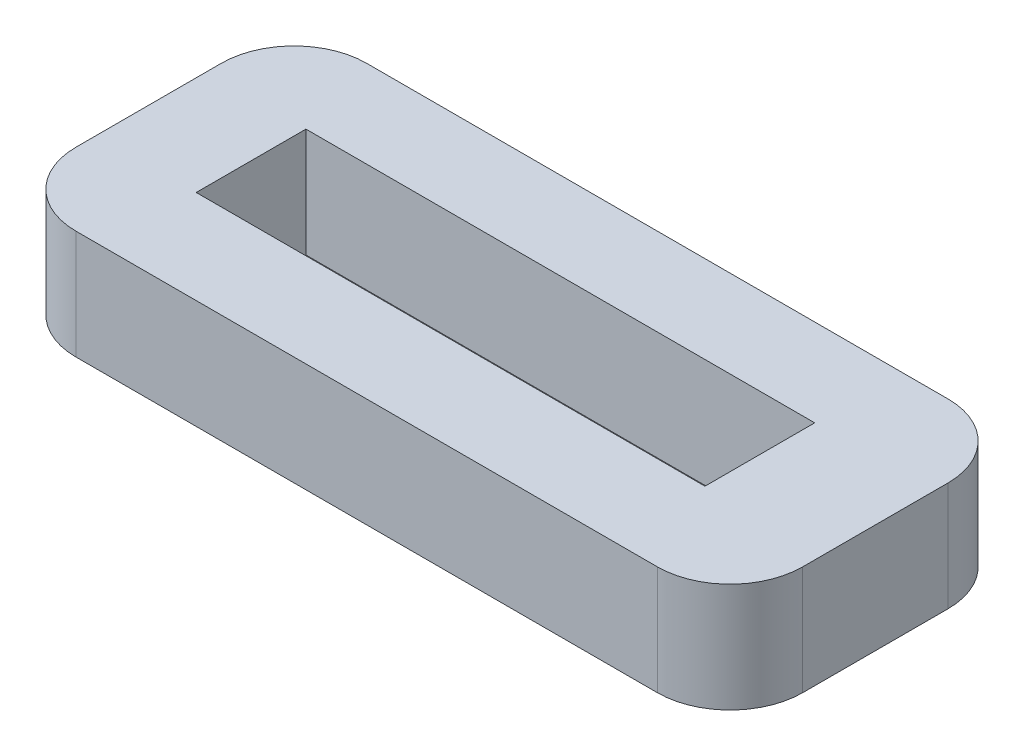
from build123d import *

# Parameters (mm, degrees)
SKETCH1_W           = 70
SKETCH1_H           = 15.1
BOSS_EXTRUDE1_DEPTH = 7.5


with BuildPart() as part:
    # Sketch1 → Boss-Extrude1 (new, symmetric)
    with BuildSketch(Plane(origin=(0, 0, 0), x_dir=(1, 0, 0), z_dir=(0, 1, 0))):
        with BuildLine():
            Line((-85.37755102, 21.263265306), (-5.37755102, 21.263265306))
            ThreePointArc((-5.37755102, 21.263265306), (1.693516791, 18.334333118), (4.62244898, 11.263265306))
            Line((4.62244898, 11.263265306), (4.62244898, -8.736734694))
            ThreePointArc((4.62244898, -8.736734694), (1.693516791, -15.807802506), (-5.37755102, -18.736734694))
            Line((-5.37755102, -18.736734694), (-85.37755102, -18.736734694))
            ThreePointArc((-85.37755102, -18.736734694), (-92.448618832, -15.807802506), (-95.37755102, -8.736734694))
            Line((-95.37755102, -8.736734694), (-95.37755102, 11.263265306))
            ThreePointArc((-95.37755102, 11.263265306), (-92.448618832, 18.334333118), (-85.37755102, 21.263265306))
        make_face()
        with Locations((-46.710204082, 1.694897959)):
            Rectangle(SKETCH1_W, SKETCH1_H, mode=Mode.SUBTRACT)
    extrude(amount=BOSS_EXTRUDE1_DEPTH, both=True)


solid = part.part
